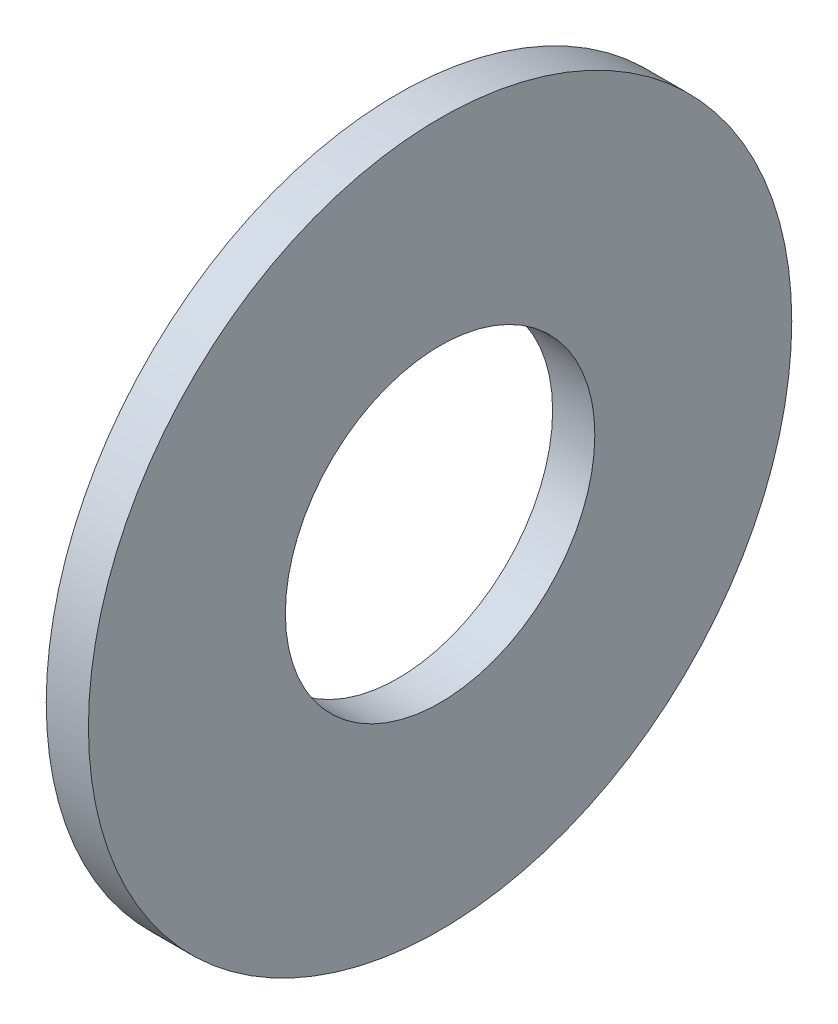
from build123d import *

# Parameters (mm, degrees)
SKETCH1_W = 0.3
SKETCH1_H = 1.4


with BuildPart() as part:
    # Sketch1 → Base-Revolve (revolve)
    with BuildSketch(Plane.XY, mode=Mode.PRIVATE) as base_revolve_sk:
        with Locations((-0.15, 1.8)):
            Rectangle(SKETCH1_W, SKETCH1_H)
    revolve(base_revolve_sk.sketch.rotate(Axis((-34.925, 0, 0), (1, 0, 0)), 90), axis=Axis((-34.925, 0, 0), (1, 0, 0)))


solid = part.part
